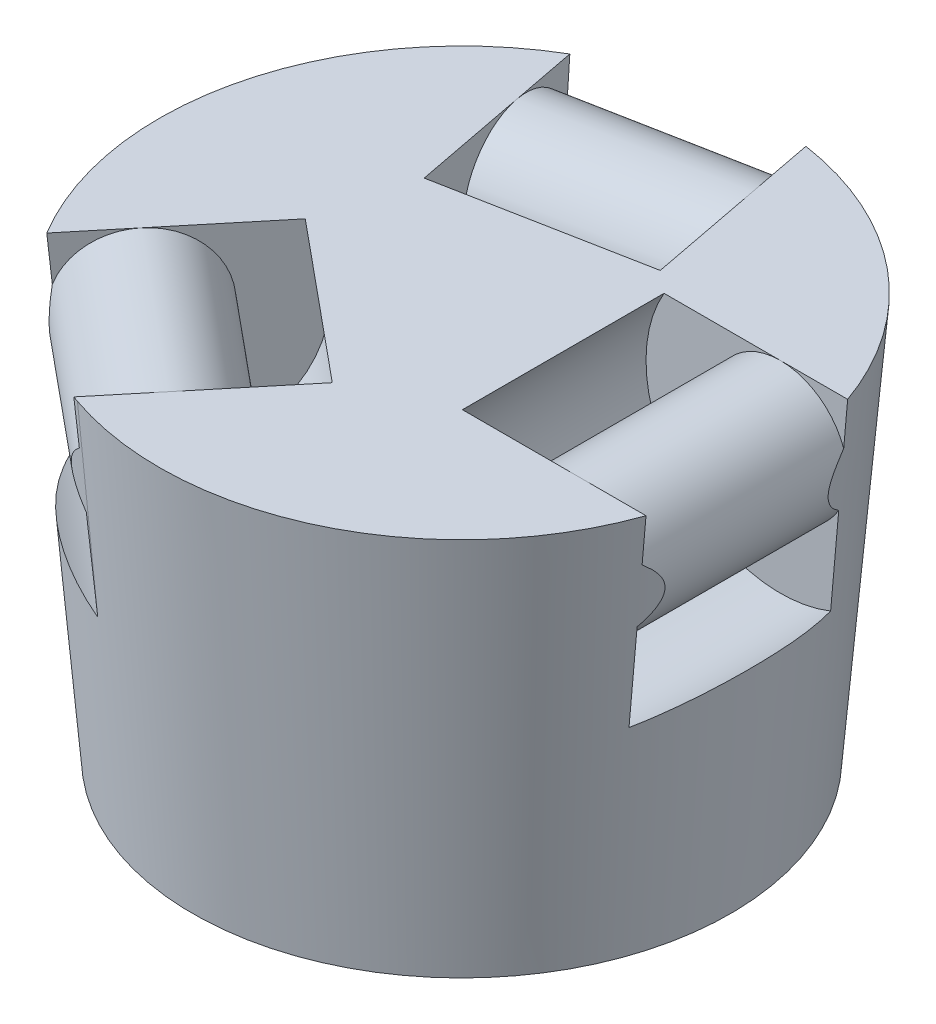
from build123d import *

# Parameters (mm, degrees)
ENL_V_MAT_EXTRU_5_DEPTH      = 15
ENL_V_MAT_EXTRU_5_DEPTH_BACK = 15
ESQUISSE24_R                 = 20
ESQUISSE24_R_2               = 10
ENL_V_MAT_EXTRU_6_DEPTH      = 15
ENL_V_MAT_EXTRU_6_DEPTH_BACK = 15
ESQUISSE21_R                 = 20
ESQUISSE21_R_2               = 10
ENL_V_MAT_EXTRU_7_DEPTH      = 15
ENL_V_MAT_EXTRU_7_DEPTH_BACK = 15
ESQUISSE19_R                 = 20
ESQUISSE19_R_2               = 10


with BuildPart() as part:
    # Esquisse1 → R_volution1 (revolve)
    with BuildSketch(Plane.XY, mode=Mode.PRIVATE) as r_volution1_sk:
        Polygon((20, 0), (20, 20), (0, 20), (0, 60), (45, 60), (40, 0), align=None)
    revolve(r_volution1_sk.sketch.rotate(Axis((0, 20, 0), (0, 1, 0)), 90), axis=Axis((0, 20, 0), (0, 1, 0)))

    # Esquisse24 → Enl_v. mat.-Extru.5 (cut, two sides: drawn at the far end of the back side and taken through both)
    with BuildSketch(Plane.XY.offset(-ENL_V_MAT_EXTRU_5_DEPTH_BACK)):
        with Locations((32.426406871, 50)):
            Circle(ESQUISSE24_R)
        with Locations(Location((32.426406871, 50, 0), (0, 0, 90))):
            Circle(ESQUISSE24_R_2, mode=Mode.SUBTRACT)
    extrude(amount=ENL_V_MAT_EXTRU_5_DEPTH + ENL_V_MAT_EXTRU_5_DEPTH_BACK, mode=Mode.SUBTRACT)

    # Esquisse21 → Enl_v. mat.-Extru.6 (cut, two sides: drawn at the far end of the back side and taken through both)
    with BuildSketch(Plane(origin=(0, 0, 0), x_dir=(0.6368635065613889, 0, -0.7709765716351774), z_dir=(0.7709765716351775, 0, 0.6368635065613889)).offset(-ENL_V_MAT_EXTRU_6_DEPTH_BACK)):
        with Locations((-32.426406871, 50)):
            Circle(ESQUISSE21_R)
        with Locations(Location((-32.426406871, 50, 0), (0, 0, 209.843229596))):
            Circle(ESQUISSE21_R_2, mode=Mode.SUBTRACT)
    extrude(amount=ENL_V_MAT_EXTRU_6_DEPTH + ENL_V_MAT_EXTRU_6_DEPTH_BACK, mode=Mode.SUBTRACT)

    # Esquisse19 → Enl_v. mat.-Extru.7 (cut, two sides: drawn at the far end of the back side and taken through both)
    with BuildSketch(Plane(origin=(0, 0, 0), x_dir=(0.18880974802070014, 0, 0.9820136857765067), z_dir=(-0.9820136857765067, 0, 0.18880974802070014)).offset(-ENL_V_MAT_EXTRU_7_DEPTH_BACK)):
        with Locations((-32.426406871, 50)):
            Circle(ESQUISSE19_R)
        with Locations(Location((-32.426406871, 50, 0), (0, 0, 209.843229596))):
            Circle(ESQUISSE19_R_2, mode=Mode.SUBTRACT)
    extrude(amount=ENL_V_MAT_EXTRU_7_DEPTH + ENL_V_MAT_EXTRU_7_DEPTH_BACK, mode=Mode.SUBTRACT)


solid = part.part
